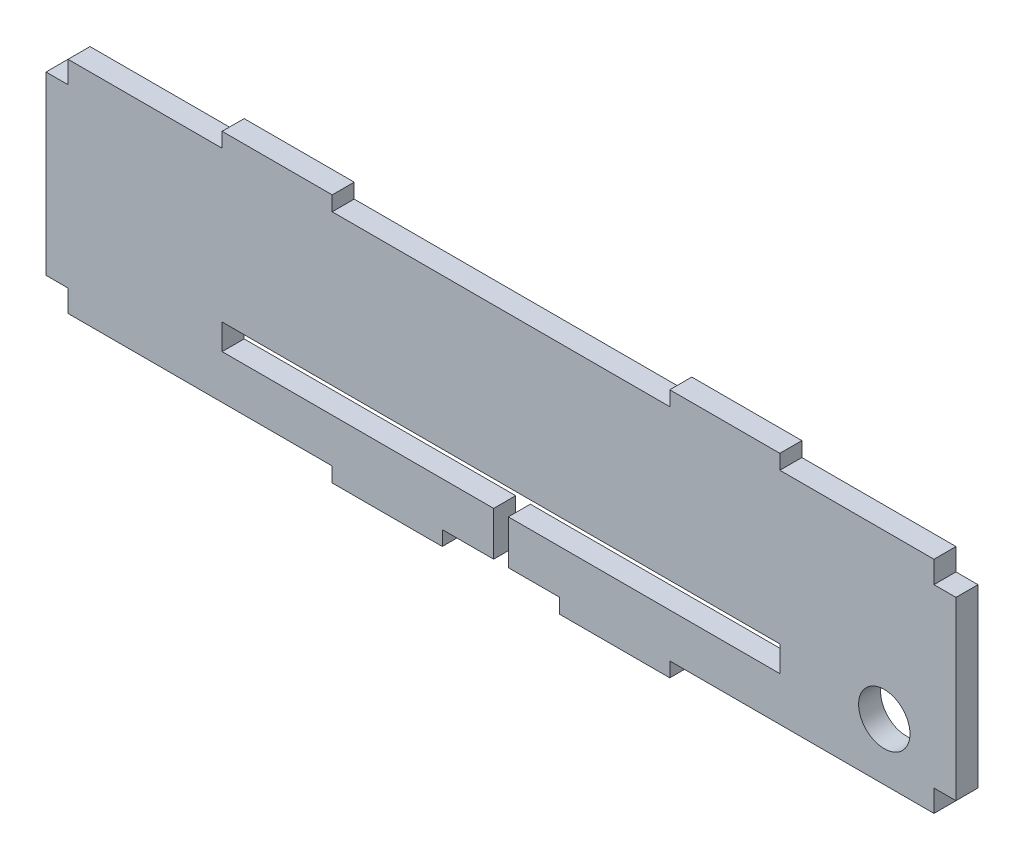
ISO-10303-21;
HEADER;
FILE_DESCRIPTION(('STEP AP214'),'2;1');
FILE_NAME('part.step','',(''),(''),'','','');
FILE_SCHEMA(('AUTOMOTIVE_DESIGN { 1 0 10303 214 1 1 1 1 }'));
ENDSEC;
DATA;
#1=APPLICATION_CONTEXT('core data for automotive mechanical design processes');
#2=APPLICATION_PROTOCOL_DEFINITION('international standard','automotive_design',2000,#1);
#3=PRODUCT_CONTEXT('',#1,'mechanical');
#4=PRODUCT('Part','Part','',(#3));
#5=PRODUCT_RELATED_PRODUCT_CATEGORY('part','',(#4));
#6=PRODUCT_DEFINITION_FORMATION('','',#4);
#7=PRODUCT_DEFINITION_CONTEXT('part definition',#1,'design');
#8=PRODUCT_DEFINITION('design','',#6,#7);
#9=PRODUCT_DEFINITION_SHAPE('','',#8);
#10=(LENGTH_UNIT() NAMED_UNIT(*) SI_UNIT(.MILLI.,.METRE.));
#11=(NAMED_UNIT(*) PLANE_ANGLE_UNIT() SI_UNIT($,.RADIAN.));
#12=(NAMED_UNIT(*) SI_UNIT($,.STERADIAN.) SOLID_ANGLE_UNIT());
#13=UNCERTAINTY_MEASURE_WITH_UNIT(LENGTH_MEASURE(1.E-05),#10,'distance_accuracy_value','');
#14=(GEOMETRIC_REPRESENTATION_CONTEXT(3) GLOBAL_UNCERTAINTY_ASSIGNED_CONTEXT((#13)) GLOBAL_UNIT_ASSIGNED_CONTEXT((#10,
#11,#12)) REPRESENTATION_CONTEXT('',''));
#15=CARTESIAN_POINT('',(0.,0.,0.));
#16=DIRECTION('',(0.,0.,1.));
#17=DIRECTION('',(1.,0.,0.));
#18=AXIS2_PLACEMENT_3D('',#15,#16,#17);
#19=CARTESIAN_POINT('',(0.,30.,3.));
#20=DIRECTION('',(0.,1.,0.));
#21=DIRECTION('',(0.,0.,1.));
#22=AXIS2_PLACEMENT_3D('',#19,#20,#21);
#23=PLANE('',#22);
#24=DIRECTION('',(1.,0.,0.));
#25=VECTOR('',#24,1.);
#26=CARTESIAN_POINT('',(0.,30.,0.));
#27=LINE('',#26,#25);
#28=CARTESIAN_POINT('',(6.00000000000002,30.,0.));
#29=VERTEX_POINT('',#28);
#30=CARTESIAN_POINT('',(27.,30.,0.));
#31=VERTEX_POINT('',#30);
#32=EDGE_CURVE('E388',#29,#31,#27,.T.);
#33=ORIENTED_EDGE('',*,*,#32,.F.);
#34=DIRECTION('',(0.,0.,-1.));
#35=VECTOR('',#34,1.);
#36=CARTESIAN_POINT('',(6.00000000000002,30.,3.));
#37=LINE('',#36,#35);
#38=CARTESIAN_POINT('',(6.00000000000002,30.,3.));
#39=VERTEX_POINT('',#38);
#40=EDGE_CURVE('E11',#39,#29,#37,.T.);
#41=ORIENTED_EDGE('',*,*,#40,.F.);
#42=DIRECTION('',(1.,0.,0.));
#43=VECTOR('',#42,1.);
#44=CARTESIAN_POINT('',(0.,30.,3.));
#45=LINE('',#44,#43);
#46=CARTESIAN_POINT('',(27.,30.,3.));
#47=VERTEX_POINT('',#46);
#48=EDGE_CURVE('E1069',#39,#47,#45,.T.);
#49=ORIENTED_EDGE('',*,*,#48,.T.);
#50=DIRECTION('',(0.,0.,-1.));
#51=VECTOR('',#50,1.);
#52=CARTESIAN_POINT('',(27.,30.,3.));
#53=LINE('',#52,#51);
#54=EDGE_CURVE('E53',#47,#31,#53,.T.);
#55=ORIENTED_EDGE('',*,*,#54,.T.);
#56=EDGE_LOOP('',(#33,#41,#49,#55));
#57=FACE_BOUND('',#56,.T.);
#58=ADVANCED_FACE('F36',(#57),#23,.T.);
#59=CARTESIAN_POINT('',(6.00000000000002,0.,3.));
#60=DIRECTION('',(1.,0.,0.));
#61=DIRECTION('',(0.,0.,-1.));
#62=AXIS2_PLACEMENT_3D('',#59,#60,#61);
#63=PLANE('',#62);
#64=DIRECTION('',(0.,-1.,0.));
#65=VECTOR('',#64,1.);
#66=CARTESIAN_POINT('',(6.00000000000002,0.,0.));
#67=LINE('',#66,#65);
#68=CARTESIAN_POINT('',(6.00000000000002,27.,0.));
#69=VERTEX_POINT('',#68);
#70=EDGE_CURVE('E385',#29,#69,#67,.T.);
#71=ORIENTED_EDGE('',*,*,#70,.T.);
#72=DIRECTION('',(0.,0.,-1.));
#73=VECTOR('',#72,1.);
#74=CARTESIAN_POINT('',(6.00000000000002,27.,3.));
#75=LINE('',#74,#73);
#76=CARTESIAN_POINT('',(6.00000000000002,27.,3.));
#77=VERTEX_POINT('',#76);
#78=EDGE_CURVE('E45',#77,#69,#75,.T.);
#79=ORIENTED_EDGE('',*,*,#78,.F.);
#80=DIRECTION('',(0.,-1.,0.));
#81=VECTOR('',#80,1.);
#82=CARTESIAN_POINT('',(6.00000000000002,0.,3.));
#83=LINE('',#82,#81);
#84=EDGE_CURVE('E1067',#39,#77,#83,.T.);
#85=ORIENTED_EDGE('',*,*,#84,.F.);
#86=ORIENTED_EDGE('',*,*,#40,.T.);
#87=EDGE_LOOP('',(#71,#79,#85,#86));
#88=FACE_BOUND('',#87,.T.);
#89=ADVANCED_FACE('F386',(#88),#63,.F.);
#90=CARTESIAN_POINT('',(0.,27.,3.));
#91=DIRECTION('',(0.,1.,0.));
#92=DIRECTION('',(0.,0.,1.));
#93=AXIS2_PLACEMENT_3D('',#90,#91,#92);
#94=PLANE('',#93);
#95=DIRECTION('',(1.,0.,0.));
#96=VECTOR('',#95,1.);
#97=CARTESIAN_POINT('',(0.,27.,0.));
#98=LINE('',#97,#96);
#99=CARTESIAN_POINT('',(3.00000000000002,27.,0.));
#100=VERTEX_POINT('',#99);
#101=EDGE_CURVE('E379',#100,#69,#98,.T.);
#102=ORIENTED_EDGE('',*,*,#101,.F.);
#103=DIRECTION('',(0.,0.,-1.));
#104=VECTOR('',#103,1.);
#105=CARTESIAN_POINT('',(3.00000000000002,27.,3.));
#106=LINE('',#105,#104);
#107=CARTESIAN_POINT('',(3.00000000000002,27.,3.));
#108=VERTEX_POINT('',#107);
#109=EDGE_CURVE('E371',#108,#100,#106,.T.);
#110=ORIENTED_EDGE('',*,*,#109,.F.);
#111=DIRECTION('',(1.,0.,0.));
#112=VECTOR('',#111,1.);
#113=CARTESIAN_POINT('',(0.,27.,3.));
#114=LINE('',#113,#112);
#115=EDGE_CURVE('E382',#108,#77,#114,.T.);
#116=ORIENTED_EDGE('',*,*,#115,.T.);
#117=ORIENTED_EDGE('',*,*,#78,.T.);
#118=EDGE_LOOP('',(#102,#110,#116,#117));
#119=FACE_BOUND('',#118,.T.);
#120=ADVANCED_FACE('F377',(#119),#94,.T.);
#121=CARTESIAN_POINT('',(3.00000000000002,0.,3.));
#122=DIRECTION('',(-1.,0.,0.));
#123=DIRECTION('',(0.,0.,1.));
#124=AXIS2_PLACEMENT_3D('',#121,#122,#123);
#125=PLANE('',#124);
#126=DIRECTION('',(0.,1.,0.));
#127=VECTOR('',#126,1.);
#128=CARTESIAN_POINT('',(3.00000000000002,0.,0.));
#129=LINE('',#128,#127);
#130=CARTESIAN_POINT('',(3.00000000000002,3.,0.));
#131=VERTEX_POINT('',#130);
#132=EDGE_CURVE('E393',#131,#100,#129,.T.);
#133=ORIENTED_EDGE('',*,*,#132,.F.);
#134=DIRECTION('',(0.,0.,-1.));
#135=VECTOR('',#134,1.);
#136=CARTESIAN_POINT('',(3.00000000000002,3.,3.));
#137=LINE('',#136,#135);
#138=CARTESIAN_POINT('',(3.00000000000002,3.,3.));
#139=VERTEX_POINT('',#138);
#140=EDGE_CURVE('E369',#139,#131,#137,.T.);
#141=ORIENTED_EDGE('',*,*,#140,.F.);
#142=DIRECTION('',(0.,1.,0.));
#143=VECTOR('',#142,1.);
#144=CARTESIAN_POINT('',(3.00000000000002,0.,3.));
#145=LINE('',#144,#143);
#146=EDGE_CURVE('E1063',#139,#108,#145,.T.);
#147=ORIENTED_EDGE('',*,*,#146,.T.);
#148=ORIENTED_EDGE('',*,*,#109,.T.);
#149=EDGE_LOOP('',(#133,#141,#147,#148));
#150=FACE_BOUND('',#149,.T.);
#151=ADVANCED_FACE('F513',(#150),#125,.T.);
#152=CARTESIAN_POINT('',(0.,3.,3.));
#153=DIRECTION('',(0.,1.,0.));
#154=DIRECTION('',(0.,0.,1.));
#155=AXIS2_PLACEMENT_3D('',#152,#153,#154);
#156=PLANE('',#155);
#157=DIRECTION('',(1.,0.,0.));
#158=VECTOR('',#157,1.);
#159=CARTESIAN_POINT('',(0.,3.,0.));
#160=LINE('',#159,#158);
#161=CARTESIAN_POINT('',(6.00000000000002,3.,0.));
#162=VERTEX_POINT('',#161);
#163=EDGE_CURVE('E395',#131,#162,#160,.T.);
#164=ORIENTED_EDGE('',*,*,#163,.T.);
#165=DIRECTION('',(0.,0.,-1.));
#166=VECTOR('',#165,1.);
#167=CARTESIAN_POINT('',(6.00000000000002,3.,3.));
#168=LINE('',#167,#166);
#169=CARTESIAN_POINT('',(6.00000000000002,3.,3.));
#170=VERTEX_POINT('',#169);
#171=EDGE_CURVE('E367',#170,#162,#168,.T.);
#172=ORIENTED_EDGE('',*,*,#171,.F.);
#173=DIRECTION('',(1.,0.,0.));
#174=VECTOR('',#173,1.);
#175=CARTESIAN_POINT('',(0.,3.,3.));
#176=LINE('',#175,#174);
#177=EDGE_CURVE('E1061',#139,#170,#176,.T.);
#178=ORIENTED_EDGE('',*,*,#177,.F.);
#179=ORIENTED_EDGE('',*,*,#140,.T.);
#180=EDGE_LOOP('',(#164,#172,#178,#179));
#181=FACE_BOUND('',#180,.T.);
#182=ADVANCED_FACE('F516',(#181),#156,.F.);
#183=CARTESIAN_POINT('',(6.00000000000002,0.,3.));
#184=DIRECTION('',(-1.,0.,0.));
#185=DIRECTION('',(0.,0.,1.));
#186=AXIS2_PLACEMENT_3D('',#183,#184,#185);
#187=PLANE('',#186);
#188=DIRECTION('',(0.,1.,0.));
#189=VECTOR('',#188,1.);
#190=CARTESIAN_POINT('',(6.00000000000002,0.,0.));
#191=LINE('',#190,#189);
#192=CARTESIAN_POINT('',(6.00000000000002,0.,0.));
#193=VERTEX_POINT('',#192);
#194=EDGE_CURVE('E401',#193,#162,#191,.T.);
#195=ORIENTED_EDGE('',*,*,#194,.F.);
#196=DIRECTION('',(0.,0.,-1.));
#197=VECTOR('',#196,1.);
#198=CARTESIAN_POINT('',(6.00000000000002,0.,3.));
#199=LINE('',#198,#197);
#200=CARTESIAN_POINT('',(6.00000000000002,0.,3.));
#201=VERTEX_POINT('',#200);
#202=EDGE_CURVE('E365',#201,#193,#199,.T.);
#203=ORIENTED_EDGE('',*,*,#202,.F.);
#204=DIRECTION('',(0.,1.,0.));
#205=VECTOR('',#204,1.);
#206=CARTESIAN_POINT('',(6.00000000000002,0.,3.));
#207=LINE('',#206,#205);
#208=EDGE_CURVE('E1058',#201,#170,#207,.T.);
#209=ORIENTED_EDGE('',*,*,#208,.T.);
#210=ORIENTED_EDGE('',*,*,#171,.T.);
#211=EDGE_LOOP('',(#195,#203,#209,#210));
#212=FACE_BOUND('',#211,.T.);
#213=ADVANCED_FACE('F520',(#212),#187,.T.);
#214=CARTESIAN_POINT('',(0.,0.,3.));
#215=DIRECTION('',(0.,1.,0.));
#216=DIRECTION('',(0.,0.,1.));
#217=AXIS2_PLACEMENT_3D('',#214,#215,#216);
#218=PLANE('',#217);
#219=DIRECTION('',(1.,0.,0.));
#220=VECTOR('',#219,1.);
#221=CARTESIAN_POINT('',(0.,0.,0.));
#222=LINE('',#221,#220);
#223=CARTESIAN_POINT('',(42.,0.,0.));
#224=VERTEX_POINT('',#223);
#225=EDGE_CURVE('E404',#193,#224,#222,.T.);
#226=ORIENTED_EDGE('',*,*,#225,.T.);
#227=DIRECTION('',(0.,0.,-1.));
#228=VECTOR('',#227,1.);
#229=CARTESIAN_POINT('',(42.,0.,3.));
#230=LINE('',#229,#228);
#231=CARTESIAN_POINT('',(42.,0.,3.));
#232=VERTEX_POINT('',#231);
#233=EDGE_CURVE('E362',#232,#224,#230,.T.);
#234=ORIENTED_EDGE('',*,*,#233,.F.);
#235=DIRECTION('',(1.,0.,0.));
#236=VECTOR('',#235,1.);
#237=CARTESIAN_POINT('',(0.,0.,3.));
#238=LINE('',#237,#236);
#239=EDGE_CURVE('E1055',#201,#232,#238,.T.);
#240=ORIENTED_EDGE('',*,*,#239,.F.);
#241=ORIENTED_EDGE('',*,*,#202,.T.);
#242=EDGE_LOOP('',(#226,#234,#240,#241));
#243=FACE_BOUND('',#242,.T.);
#244=ADVANCED_FACE('F524',(#243),#218,.F.);
#245=CARTESIAN_POINT('',(42.,2.91433543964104E-13,3.));
#246=DIRECTION('',(1.,0.,0.));
#247=DIRECTION('',(0.,1.,0.));
#248=AXIS2_PLACEMENT_3D('',#245,#246,#247);
#249=PLANE('',#248);
#250=DIRECTION('',(0.,-1.,0.));
#251=VECTOR('',#250,1.);
#252=CARTESIAN_POINT('',(42.,2.91433543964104E-13,0.));
#253=LINE('',#252,#251);
#254=CARTESIAN_POINT('',(42.,-2.,0.));
#255=VERTEX_POINT('',#254);
#256=EDGE_CURVE('E407',#224,#255,#253,.T.);
#257=ORIENTED_EDGE('',*,*,#256,.T.);
#258=DIRECTION('',(0.,0.,-1.));
#259=VECTOR('',#258,1.);
#260=CARTESIAN_POINT('',(42.,-2.,3.));
#261=LINE('',#260,#259);
#262=CARTESIAN_POINT('',(42.,-2.,3.));
#263=VERTEX_POINT('',#262);
#264=EDGE_CURVE('E359',#263,#255,#261,.T.);
#265=ORIENTED_EDGE('',*,*,#264,.F.);
#266=DIRECTION('',(0.,-1.,0.));
#267=VECTOR('',#266,1.);
#268=CARTESIAN_POINT('',(42.,2.91433543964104E-13,3.));
#269=LINE('',#268,#267);
#270=EDGE_CURVE('E1052',#232,#263,#269,.T.);
#271=ORIENTED_EDGE('',*,*,#270,.F.);
#272=ORIENTED_EDGE('',*,*,#233,.T.);
#273=EDGE_LOOP('',(#257,#265,#271,#272));
#274=FACE_BOUND('',#273,.T.);
#275=ADVANCED_FACE('F528',(#274),#249,.F.);
#276=CARTESIAN_POINT('',(0.,-2.,3.));
#277=DIRECTION('',(0.,1.,0.));
#278=DIRECTION('',(-1.,0.,0.));
#279=AXIS2_PLACEMENT_3D('',#276,#277,#278);
#280=PLANE('',#279);
#281=DIRECTION('',(1.,0.,0.));
#282=VECTOR('',#281,1.);
#283=CARTESIAN_POINT('',(0.,-2.,0.));
#284=LINE('',#283,#282);
#285=CARTESIAN_POINT('',(57.,-2.,0.));
#286=VERTEX_POINT('',#285);
#287=EDGE_CURVE('E410',#255,#286,#284,.T.);
#288=ORIENTED_EDGE('',*,*,#287,.T.);
#289=DIRECTION('',(0.,0.,-1.));
#290=VECTOR('',#289,1.);
#291=CARTESIAN_POINT('',(57.,-2.,3.));
#292=LINE('',#291,#290);
#293=CARTESIAN_POINT('',(57.,-2.,3.));
#294=VERTEX_POINT('',#293);
#295=EDGE_CURVE('E356',#294,#286,#292,.T.);
#296=ORIENTED_EDGE('',*,*,#295,.F.);
#297=DIRECTION('',(1.,0.,0.));
#298=VECTOR('',#297,1.);
#299=CARTESIAN_POINT('',(0.,-2.,3.));
#300=LINE('',#299,#298);
#301=EDGE_CURVE('E960',#263,#294,#300,.T.);
#302=ORIENTED_EDGE('',*,*,#301,.F.);
#303=ORIENTED_EDGE('',*,*,#264,.T.);
#304=EDGE_LOOP('',(#288,#296,#302,#303));
#305=FACE_BOUND('',#304,.T.);
#306=ADVANCED_FACE('F532',(#305),#280,.F.);
#307=CARTESIAN_POINT('',(57.,0.,3.));
#308=DIRECTION('',(-1.,0.,0.));
#309=DIRECTION('',(0.,0.,1.));
#310=AXIS2_PLACEMENT_3D('',#307,#308,#309);
#311=PLANE('',#310);
#312=DIRECTION('',(0.,1.,0.));
#313=VECTOR('',#312,1.);
#314=CARTESIAN_POINT('',(57.,0.,0.));
#315=LINE('',#314,#313);
#316=CARTESIAN_POINT('',(57.,0.,0.));
#317=VERTEX_POINT('',#316);
#318=EDGE_CURVE('E413',#286,#317,#315,.T.);
#319=ORIENTED_EDGE('',*,*,#318,.T.);
#320=DIRECTION('',(0.,0.,-1.));
#321=VECTOR('',#320,1.);
#322=CARTESIAN_POINT('',(57.,0.,3.));
#323=LINE('',#322,#321);
#324=CARTESIAN_POINT('',(57.,0.,3.));
#325=VERTEX_POINT('',#324);
#326=EDGE_CURVE('E353',#325,#317,#323,.T.);
#327=ORIENTED_EDGE('',*,*,#326,.F.);
#328=DIRECTION('',(0.,1.,0.));
#329=VECTOR('',#328,1.);
#330=CARTESIAN_POINT('',(57.,0.,3.));
#331=LINE('',#330,#329);
#332=EDGE_CURVE('E957',#294,#325,#331,.T.);
#333=ORIENTED_EDGE('',*,*,#332,.F.);
#334=ORIENTED_EDGE('',*,*,#295,.T.);
#335=EDGE_LOOP('',(#319,#327,#333,#334));
#336=FACE_BOUND('',#335,.T.);
#337=ADVANCED_FACE('F536',(#336),#311,.F.);
#338=CARTESIAN_POINT('',(0.,0.,3.));
#339=DIRECTION('',(0.,1.,0.));
#340=DIRECTION('',(-1.,0.,0.));
#341=AXIS2_PLACEMENT_3D('',#338,#339,#340);
#342=PLANE('',#341);
#343=DIRECTION('',(1.,0.,0.));
#344=VECTOR('',#343,1.);
#345=CARTESIAN_POINT('',(0.,0.,0.));
#346=LINE('',#345,#344);
#347=CARTESIAN_POINT('',(64.,0.,0.));
#348=VERTEX_POINT('',#347);
#349=EDGE_CURVE('E416',#317,#348,#346,.T.);
#350=ORIENTED_EDGE('',*,*,#349,.T.);
#351=DIRECTION('',(0.,0.,-1.));
#352=VECTOR('',#351,1.);
#353=CARTESIAN_POINT('',(64.,0.,3.));
#354=LINE('',#353,#352);
#355=CARTESIAN_POINT('',(64.,0.,3.));
#356=VERTEX_POINT('',#355);
#357=EDGE_CURVE('E350',#356,#348,#354,.T.);
#358=ORIENTED_EDGE('',*,*,#357,.F.);
#359=DIRECTION('',(1.,0.,0.));
#360=VECTOR('',#359,1.);
#361=CARTESIAN_POINT('',(0.,0.,3.));
#362=LINE('',#361,#360);
#363=EDGE_CURVE('E953',#325,#356,#362,.T.);
#364=ORIENTED_EDGE('',*,*,#363,.F.);
#365=ORIENTED_EDGE('',*,*,#326,.T.);
#366=EDGE_LOOP('',(#350,#358,#364,#365));
#367=FACE_BOUND('',#366,.T.);
#368=ADVANCED_FACE('F540',(#367),#342,.F.);
#369=CARTESIAN_POINT('',(64.,0.,3.));
#370=DIRECTION('',(-1.,0.,0.));
#371=DIRECTION('',(0.,0.,1.));
#372=AXIS2_PLACEMENT_3D('',#369,#370,#371);
#373=PLANE('',#372);
#374=DIRECTION('',(0.,1.,0.));
#375=VECTOR('',#374,1.);
#376=CARTESIAN_POINT('',(64.,0.,0.));
#377=LINE('',#376,#375);
#378=CARTESIAN_POINT('',(64.,6.,0.));
#379=VERTEX_POINT('',#378);
#380=EDGE_CURVE('E419',#348,#379,#377,.T.);
#381=ORIENTED_EDGE('',*,*,#380,.T.);
#382=DIRECTION('',(0.,0.,-1.));
#383=VECTOR('',#382,1.);
#384=CARTESIAN_POINT('',(64.,6.,3.));
#385=LINE('',#384,#383);
#386=CARTESIAN_POINT('',(64.,6.,3.));
#387=VERTEX_POINT('',#386);
#388=EDGE_CURVE('E348',#387,#379,#385,.T.);
#389=ORIENTED_EDGE('',*,*,#388,.F.);
#390=DIRECTION('',(0.,1.,0.));
#391=VECTOR('',#390,1.);
#392=CARTESIAN_POINT('',(64.,0.,3.));
#393=LINE('',#392,#391);
#394=EDGE_CURVE('E948',#356,#387,#393,.T.);
#395=ORIENTED_EDGE('',*,*,#394,.F.);
#396=ORIENTED_EDGE('',*,*,#357,.T.);
#397=EDGE_LOOP('',(#381,#389,#395,#396));
#398=FACE_BOUND('',#397,.T.);
#399=ADVANCED_FACE('F542',(#398),#373,.F.);
#400=CARTESIAN_POINT('',(0.,6.,3.));
#401=DIRECTION('',(0.,1.,0.));
#402=DIRECTION('',(0.,0.,1.));
#403=AXIS2_PLACEMENT_3D('',#400,#401,#402);
#404=PLANE('',#403);
#405=DIRECTION('',(1.,0.,0.));
#406=VECTOR('',#405,1.);
#407=CARTESIAN_POINT('',(0.,6.,0.));
#408=LINE('',#407,#406);
#409=CARTESIAN_POINT('',(27.,6.,0.));
#410=VERTEX_POINT('',#409);
#411=EDGE_CURVE('E423',#410,#379,#408,.T.);
#412=ORIENTED_EDGE('',*,*,#411,.F.);
#413=DIRECTION('',(0.,0.,-1.));
#414=VECTOR('',#413,1.);
#415=CARTESIAN_POINT('',(27.,6.,3.));
#416=LINE('',#415,#414);
#417=CARTESIAN_POINT('',(27.,6.,3.));
#418=VERTEX_POINT('',#417);
#419=EDGE_CURVE('E346',#418,#410,#416,.T.);
#420=ORIENTED_EDGE('',*,*,#419,.F.);
#421=DIRECTION('',(1.,0.,0.));
#422=VECTOR('',#421,1.);
#423=CARTESIAN_POINT('',(0.,6.,3.));
#424=LINE('',#423,#422);
#425=EDGE_CURVE('E952',#418,#387,#424,.T.);
#426=ORIENTED_EDGE('',*,*,#425,.T.);
#427=ORIENTED_EDGE('',*,*,#388,.T.);
#428=EDGE_LOOP('',(#412,#420,#426,#427));
#429=FACE_BOUND('',#428,.T.);
#430=ADVANCED_FACE('F545',(#429),#404,.T.);
#431=CARTESIAN_POINT('',(27.,0.,3.));
#432=DIRECTION('',(1.,0.,0.));
#433=DIRECTION('',(0.,0.,-1.));
#434=AXIS2_PLACEMENT_3D('',#431,#432,#433);
#435=PLANE('',#434);
#436=DIRECTION('',(0.,-1.,0.));
#437=VECTOR('',#436,1.);
#438=CARTESIAN_POINT('',(27.,0.,0.));
#439=LINE('',#438,#437);
#440=CARTESIAN_POINT('',(27.,9.5,0.));
#441=VERTEX_POINT('',#440);
#442=EDGE_CURVE('E426',#441,#410,#439,.T.);
#443=ORIENTED_EDGE('',*,*,#442,.F.);
#444=DIRECTION('',(0.,0.,-1.));
#445=VECTOR('',#444,1.);
#446=CARTESIAN_POINT('',(27.,9.5,3.));
#447=LINE('',#446,#445);
#448=CARTESIAN_POINT('',(27.,9.5,3.));
#449=VERTEX_POINT('',#448);
#450=EDGE_CURVE('E344',#449,#441,#447,.T.);
#451=ORIENTED_EDGE('',*,*,#450,.F.);
#452=DIRECTION('',(0.,-1.,0.));
#453=VECTOR('',#452,1.);
#454=CARTESIAN_POINT('',(27.,0.,3.));
#455=LINE('',#454,#453);
#456=EDGE_CURVE('E1045',#449,#418,#455,.T.);
#457=ORIENTED_EDGE('',*,*,#456,.T.);
#458=ORIENTED_EDGE('',*,*,#419,.T.);
#459=EDGE_LOOP('',(#443,#451,#457,#458));
#460=FACE_BOUND('',#459,.T.);
#461=ADVANCED_FACE('F549',(#460),#435,.T.);
#462=CARTESIAN_POINT('',(0.,9.5,3.));
#463=DIRECTION('',(0.,1.,0.));
#464=DIRECTION('',(0.,0.,1.));
#465=AXIS2_PLACEMENT_3D('',#462,#463,#464);
#466=PLANE('',#465);
#467=DIRECTION('',(1.,0.,0.));
#468=VECTOR('',#467,1.);
#469=CARTESIAN_POINT('',(0.,9.5,0.));
#470=LINE('',#469,#468);
#471=CARTESIAN_POINT('',(103.,9.5,0.));
#472=VERTEX_POINT('',#471);
#473=EDGE_CURVE('E429',#441,#472,#470,.T.);
#474=ORIENTED_EDGE('',*,*,#473,.T.);
#475=DIRECTION('',(0.,0.,-1.));
#476=VECTOR('',#475,1.);
#477=CARTESIAN_POINT('',(103.,9.5,3.));
#478=LINE('',#477,#476);
#479=CARTESIAN_POINT('',(103.,9.5,3.));
#480=VERTEX_POINT('',#479);
#481=EDGE_CURVE('E341',#480,#472,#478,.T.);
#482=ORIENTED_EDGE('',*,*,#481,.F.);
#483=DIRECTION('',(1.,0.,0.));
#484=VECTOR('',#483,1.);
#485=CARTESIAN_POINT('',(0.,9.5,3.));
#486=LINE('',#485,#484);
#487=EDGE_CURVE('E1047',#449,#480,#486,.T.);
#488=ORIENTED_EDGE('',*,*,#487,.F.);
#489=ORIENTED_EDGE('',*,*,#450,.T.);
#490=EDGE_LOOP('',(#474,#482,#488,#489));
#491=FACE_BOUND('',#490,.T.);
#492=ADVANCED_FACE('F553',(#491),#466,.F.);
#493=CARTESIAN_POINT('',(103.,0.,3.));
#494=DIRECTION('',(1.,0.,0.));
#495=DIRECTION('',(0.,0.,-1.));
#496=AXIS2_PLACEMENT_3D('',#493,#494,#495);
#497=PLANE('',#496);
#498=DIRECTION('',(0.,-1.,0.));
#499=VECTOR('',#498,1.);
#500=CARTESIAN_POINT('',(103.,0.,0.));
#501=LINE('',#500,#499);
#502=CARTESIAN_POINT('',(103.,6.,0.));
#503=VERTEX_POINT('',#502);
#504=EDGE_CURVE('E432',#472,#503,#501,.T.);
#505=ORIENTED_EDGE('',*,*,#504,.T.);
#506=DIRECTION('',(0.,0.,-1.));
#507=VECTOR('',#506,1.);
#508=CARTESIAN_POINT('',(103.,6.,3.));
#509=LINE('',#508,#507);
#510=CARTESIAN_POINT('',(103.,6.,3.));
#511=VERTEX_POINT('',#510);
#512=EDGE_CURVE('E339',#511,#503,#509,.T.);
#513=ORIENTED_EDGE('',*,*,#512,.F.);
#514=DIRECTION('',(0.,-1.,0.));
#515=VECTOR('',#514,1.);
#516=CARTESIAN_POINT('',(103.,0.,3.));
#517=LINE('',#516,#515);
#518=EDGE_CURVE('E975',#480,#511,#517,.T.);
#519=ORIENTED_EDGE('',*,*,#518,.F.);
#520=ORIENTED_EDGE('',*,*,#481,.T.);
#521=EDGE_LOOP('',(#505,#513,#519,#520));
#522=FACE_BOUND('',#521,.T.);
#523=ADVANCED_FACE('F557',(#522),#497,.F.);
#524=CARTESIAN_POINT('',(0.,6.,3.));
#525=DIRECTION('',(0.,1.,0.));
#526=DIRECTION('',(0.,0.,1.));
#527=AXIS2_PLACEMENT_3D('',#524,#525,#526);
#528=PLANE('',#527);
#529=DIRECTION('',(1.,0.,0.));
#530=VECTOR('',#529,1.);
#531=CARTESIAN_POINT('',(0.,6.,0.));
#532=LINE('',#531,#530);
#533=CARTESIAN_POINT('',(66.,6.,0.));
#534=VERTEX_POINT('',#533);
#535=EDGE_CURVE('E435',#534,#503,#532,.T.);
#536=ORIENTED_EDGE('',*,*,#535,.F.);
#537=DIRECTION('',(0.,0.,-1.));
#538=VECTOR('',#537,1.);
#539=CARTESIAN_POINT('',(66.,6.,3.));
#540=LINE('',#539,#538);
#541=CARTESIAN_POINT('',(66.,6.,3.));
#542=VERTEX_POINT('',#541);
#543=EDGE_CURVE('E337',#542,#534,#540,.T.);
#544=ORIENTED_EDGE('',*,*,#543,.F.);
#545=DIRECTION('',(1.,0.,0.));
#546=VECTOR('',#545,1.);
#547=CARTESIAN_POINT('',(0.,6.,3.));
#548=LINE('',#547,#546);
#549=EDGE_CURVE('E972',#542,#511,#548,.T.);
#550=ORIENTED_EDGE('',*,*,#549,.T.);
#551=ORIENTED_EDGE('',*,*,#512,.T.);
#552=EDGE_LOOP('',(#536,#544,#550,#551));
#553=FACE_BOUND('',#552,.T.);
#554=ADVANCED_FACE('F561',(#553),#528,.T.);
#555=CARTESIAN_POINT('',(66.,0.,3.));
#556=DIRECTION('',(-1.,0.,0.));
#557=DIRECTION('',(0.,0.,1.));
#558=AXIS2_PLACEMENT_3D('',#555,#556,#557);
#559=PLANE('',#558);
#560=DIRECTION('',(0.,1.,0.));
#561=VECTOR('',#560,1.);
#562=CARTESIAN_POINT('',(66.,0.,0.));
#563=LINE('',#562,#561);
#564=CARTESIAN_POINT('',(66.,0.,0.));
#565=VERTEX_POINT('',#564);
#566=EDGE_CURVE('E438',#565,#534,#563,.T.);
#567=ORIENTED_EDGE('',*,*,#566,.F.);
#568=DIRECTION('',(0.,0.,-1.));
#569=VECTOR('',#568,1.);
#570=CARTESIAN_POINT('',(66.,0.,3.));
#571=LINE('',#570,#569);
#572=CARTESIAN_POINT('',(66.,0.,3.));
#573=VERTEX_POINT('',#572);
#574=EDGE_CURVE('E335',#573,#565,#571,.T.);
#575=ORIENTED_EDGE('',*,*,#574,.F.);
#576=DIRECTION('',(0.,1.,0.));
#577=VECTOR('',#576,1.);
#578=CARTESIAN_POINT('',(66.,0.,3.));
#579=LINE('',#578,#577);
#580=EDGE_CURVE('E964',#573,#542,#579,.T.);
#581=ORIENTED_EDGE('',*,*,#580,.T.);
#582=ORIENTED_EDGE('',*,*,#543,.T.);
#583=EDGE_LOOP('',(#567,#575,#581,#582));
#584=FACE_BOUND('',#583,.T.);
#585=ADVANCED_FACE('F565',(#584),#559,.T.);
#586=CARTESIAN_POINT('',(73.,0.,0.));
#587=VERTEX_POINT('',#586);
#588=EDGE_CURVE('E420',#565,#587,#346,.T.);
#589=ORIENTED_EDGE('',*,*,#588,.T.);
#590=DIRECTION('',(0.,0.,-1.));
#591=VECTOR('',#590,1.);
#592=CARTESIAN_POINT('',(73.,0.,3.));
#593=LINE('',#592,#591);
#594=CARTESIAN_POINT('',(73.,0.,3.));
#595=VERTEX_POINT('',#594);
#596=EDGE_CURVE('E332',#595,#587,#593,.T.);
#597=ORIENTED_EDGE('',*,*,#596,.F.);
#598=EDGE_CURVE('E959',#573,#595,#362,.T.);
#599=ORIENTED_EDGE('',*,*,#598,.F.);
#600=ORIENTED_EDGE('',*,*,#574,.T.);
#601=EDGE_LOOP('',(#589,#597,#599,#600));
#602=FACE_BOUND('',#601,.T.);
#603=ADVANCED_FACE('F569',(#602),#342,.F.);
#604=CARTESIAN_POINT('',(73.,0.,3.));
#605=DIRECTION('',(1.,0.,0.));
#606=DIRECTION('',(0.,0.,-1.));
#607=AXIS2_PLACEMENT_3D('',#604,#605,#606);
#608=PLANE('',#607);
#609=DIRECTION('',(0.,-1.,0.));
#610=VECTOR('',#609,1.);
#611=CARTESIAN_POINT('',(73.,0.,0.));
#612=LINE('',#611,#610);
#613=CARTESIAN_POINT('',(73.,-2.,0.));
#614=VERTEX_POINT('',#613);
#615=EDGE_CURVE('E441',#587,#614,#612,.T.);
#616=ORIENTED_EDGE('',*,*,#615,.T.);
#617=DIRECTION('',(0.,0.,-1.));
#618=VECTOR('',#617,1.);
#619=CARTESIAN_POINT('',(73.,-2.,3.));
#620=LINE('',#619,#618);
#621=CARTESIAN_POINT('',(73.,-2.,3.));
#622=VERTEX_POINT('',#621);
#623=EDGE_CURVE('E329',#622,#614,#620,.T.);
#624=ORIENTED_EDGE('',*,*,#623,.F.);
#625=DIRECTION('',(0.,-1.,0.));
#626=VECTOR('',#625,1.);
#627=CARTESIAN_POINT('',(73.,0.,3.));
#628=LINE('',#627,#626);
#629=EDGE_CURVE('E963',#595,#622,#628,.T.);
#630=ORIENTED_EDGE('',*,*,#629,.F.);
#631=ORIENTED_EDGE('',*,*,#596,.T.);
#632=EDGE_LOOP('',(#616,#624,#630,#631));
#633=FACE_BOUND('',#632,.T.);
#634=ADVANCED_FACE('F573',(#633),#608,.F.);
#635=CARTESIAN_POINT('',(0.,-2.,3.));
#636=DIRECTION('',(0.,1.,0.));
#637=DIRECTION('',(-1.,0.,0.));
#638=AXIS2_PLACEMENT_3D('',#635,#636,#637);
#639=PLANE('',#638);
#640=DIRECTION('',(1.,0.,0.));
#641=VECTOR('',#640,1.);
#642=CARTESIAN_POINT('',(0.,-2.,0.));
#643=LINE('',#642,#641);
#644=CARTESIAN_POINT('',(88.,-2.,0.));
#645=VERTEX_POINT('',#644);
#646=EDGE_CURVE('E444',#614,#645,#643,.T.);
#647=ORIENTED_EDGE('',*,*,#646,.T.);
#648=DIRECTION('',(0.,0.,-1.));
#649=VECTOR('',#648,1.);
#650=CARTESIAN_POINT('',(88.,-2.,3.));
#651=LINE('',#650,#649);
#652=CARTESIAN_POINT('',(88.,-2.,3.));
#653=VERTEX_POINT('',#652);
#654=EDGE_CURVE('E326',#653,#645,#651,.T.);
#655=ORIENTED_EDGE('',*,*,#654,.F.);
#656=DIRECTION('',(1.,0.,0.));
#657=VECTOR('',#656,1.);
#658=CARTESIAN_POINT('',(0.,-2.,3.));
#659=LINE('',#658,#657);
#660=EDGE_CURVE('E969',#622,#653,#659,.T.);
#661=ORIENTED_EDGE('',*,*,#660,.F.);
#662=ORIENTED_EDGE('',*,*,#623,.T.);
#663=EDGE_LOOP('',(#647,#655,#661,#662));
#664=FACE_BOUND('',#663,.T.);
#665=ADVANCED_FACE('F577',(#664),#639,.F.);
#666=CARTESIAN_POINT('',(88.,-6.10622663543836E-13,3.));
#667=DIRECTION('',(-1.,0.,0.));
#668=DIRECTION('',(0.,-1.,0.));
#669=AXIS2_PLACEMENT_3D('',#666,#667,#668);
#670=PLANE('',#669);
#671=DIRECTION('',(0.,1.,0.));
#672=VECTOR('',#671,1.);
#673=CARTESIAN_POINT('',(88.,-6.10622663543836E-13,0.));
#674=LINE('',#673,#672);
#675=CARTESIAN_POINT('',(88.,0.,0.));
#676=VERTEX_POINT('',#675);
#677=EDGE_CURVE('E447',#645,#676,#674,.T.);
#678=ORIENTED_EDGE('',*,*,#677,.T.);
#679=DIRECTION('',(0.,0.,-1.));
#680=VECTOR('',#679,1.);
#681=CARTESIAN_POINT('',(88.,0.,3.));
#682=LINE('',#681,#680);
#683=CARTESIAN_POINT('',(88.,0.,3.));
#684=VERTEX_POINT('',#683);
#685=EDGE_CURVE('E323',#684,#676,#682,.T.);
#686=ORIENTED_EDGE('',*,*,#685,.F.);
#687=DIRECTION('',(0.,1.,0.));
#688=VECTOR('',#687,1.);
#689=CARTESIAN_POINT('',(88.,-6.10622663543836E-13,3.));
#690=LINE('',#689,#688);
#691=EDGE_CURVE('E981',#653,#684,#690,.T.);
#692=ORIENTED_EDGE('',*,*,#691,.F.);
#693=ORIENTED_EDGE('',*,*,#654,.T.);
#694=EDGE_LOOP('',(#678,#686,#692,#693));
#695=FACE_BOUND('',#694,.T.);
#696=ADVANCED_FACE('F581',(#695),#670,.F.);
#697=CARTESIAN_POINT('',(0.,0.,3.));
#698=DIRECTION('',(0.,1.,0.));
#699=DIRECTION('',(-1.,0.,0.));
#700=AXIS2_PLACEMENT_3D('',#697,#698,#699);
#701=PLANE('',#700);
#702=DIRECTION('',(1.,0.,0.));
#703=VECTOR('',#702,1.);
#704=CARTESIAN_POINT('',(0.,0.,0.));
#705=LINE('',#704,#703);
#706=CARTESIAN_POINT('',(124.,0.,0.));
#707=VERTEX_POINT('',#706);
#708=EDGE_CURVE('E450',#676,#707,#705,.T.);
#709=ORIENTED_EDGE('',*,*,#708,.T.);
#710=DIRECTION('',(0.,0.,-1.));
#711=VECTOR('',#710,1.);
#712=CARTESIAN_POINT('',(124.,0.,3.));
#713=LINE('',#712,#711);
#714=CARTESIAN_POINT('',(124.,0.,3.));
#715=VERTEX_POINT('',#714);
#716=EDGE_CURVE('E320',#715,#707,#713,.T.);
#717=ORIENTED_EDGE('',*,*,#716,.F.);
#718=DIRECTION('',(1.,0.,0.));
#719=VECTOR('',#718,1.);
#720=CARTESIAN_POINT('',(0.,0.,3.));
#721=LINE('',#720,#719);
#722=EDGE_CURVE('E984',#684,#715,#721,.T.);
#723=ORIENTED_EDGE('',*,*,#722,.F.);
#724=ORIENTED_EDGE('',*,*,#685,.T.);
#725=EDGE_LOOP('',(#709,#717,#723,#724));
#726=FACE_BOUND('',#725,.T.);
#727=ADVANCED_FACE('F585',(#726),#701,.F.);
#728=CARTESIAN_POINT('',(124.,0.,3.));
#729=DIRECTION('',(-1.,0.,0.));
#730=DIRECTION('',(0.,0.,1.));
#731=AXIS2_PLACEMENT_3D('',#728,#729,#730);
#732=PLANE('',#731);
#733=DIRECTION('',(0.,1.,0.));
#734=VECTOR('',#733,1.);
#735=CARTESIAN_POINT('',(124.,0.,0.));
#736=LINE('',#735,#734);
#737=CARTESIAN_POINT('',(124.,3.00000000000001,0.));
#738=VERTEX_POINT('',#737);
#739=EDGE_CURVE('E453',#707,#738,#736,.T.);
#740=ORIENTED_EDGE('',*,*,#739,.T.);
#741=DIRECTION('',(0.,0.,-1.));
#742=VECTOR('',#741,1.);
#743=CARTESIAN_POINT('',(124.,3.00000000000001,3.));
#744=LINE('',#743,#742);
#745=CARTESIAN_POINT('',(124.,3.00000000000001,3.));
#746=VERTEX_POINT('',#745);
#747=EDGE_CURVE('E318',#746,#738,#744,.T.);
#748=ORIENTED_EDGE('',*,*,#747,.F.);
#749=DIRECTION('',(0.,1.,0.));
#750=VECTOR('',#749,1.);
#751=CARTESIAN_POINT('',(124.,0.,3.));
#752=LINE('',#751,#750);
#753=EDGE_CURVE('E987',#715,#746,#752,.T.);
#754=ORIENTED_EDGE('',*,*,#753,.F.);
#755=ORIENTED_EDGE('',*,*,#716,.T.);
#756=EDGE_LOOP('',(#740,#748,#754,#755));
#757=FACE_BOUND('',#756,.T.);
#758=ADVANCED_FACE('F589',(#757),#732,.F.);
#759=CARTESIAN_POINT('',(0.,2.99999999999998,3.));
#760=DIRECTION('',(0.,-1.,0.));
#761=DIRECTION('',(1.,0.,0.));
#762=AXIS2_PLACEMENT_3D('',#759,#760,#761);
#763=PLANE('',#762);
#764=DIRECTION('',(-1.,0.,0.));
#765=VECTOR('',#764,1.);
#766=CARTESIAN_POINT('',(0.,2.99999999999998,0.));
#767=LINE('',#766,#765);
#768=CARTESIAN_POINT('',(127.,3.00000000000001,0.));
#769=VERTEX_POINT('',#768);
#770=EDGE_CURVE('E456',#769,#738,#767,.T.);
#771=ORIENTED_EDGE('',*,*,#770,.F.);
#772=DIRECTION('',(0.,0.,-1.));
#773=VECTOR('',#772,1.);
#774=CARTESIAN_POINT('',(127.,3.00000000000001,3.));
#775=LINE('',#774,#773);
#776=CARTESIAN_POINT('',(127.,3.00000000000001,3.));
#777=VERTEX_POINT('',#776);
#778=EDGE_CURVE('E316',#777,#769,#775,.T.);
#779=ORIENTED_EDGE('',*,*,#778,.F.);
#780=DIRECTION('',(-1.,0.,0.));
#781=VECTOR('',#780,1.);
#782=CARTESIAN_POINT('',(0.,2.99999999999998,3.));
#783=LINE('',#782,#781);
#784=EDGE_CURVE('E989',#777,#746,#783,.T.);
#785=ORIENTED_EDGE('',*,*,#784,.T.);
#786=ORIENTED_EDGE('',*,*,#747,.T.);
#787=EDGE_LOOP('',(#771,#779,#785,#786));
#788=FACE_BOUND('',#787,.T.);
#789=ADVANCED_FACE('F593',(#788),#763,.T.);
#790=CARTESIAN_POINT('',(127.,0.,3.));
#791=DIRECTION('',(-1.,0.,0.));
#792=DIRECTION('',(0.,0.,1.));
#793=AXIS2_PLACEMENT_3D('',#790,#791,#792);
#794=PLANE('',#793);
#795=DIRECTION('',(0.,1.,0.));
#796=VECTOR('',#795,1.);
#797=CARTESIAN_POINT('',(127.,0.,0.));
#798=LINE('',#797,#796);
#799=CARTESIAN_POINT('',(127.,27.,0.));
#800=VERTEX_POINT('',#799);
#801=EDGE_CURVE('E459',#769,#800,#798,.T.);
#802=ORIENTED_EDGE('',*,*,#801,.T.);
#803=DIRECTION('',(0.,0.,-1.));
#804=VECTOR('',#803,1.);
#805=CARTESIAN_POINT('',(127.,27.,3.));
#806=LINE('',#805,#804);
#807=CARTESIAN_POINT('',(127.,27.,3.));
#808=VERTEX_POINT('',#807);
#809=EDGE_CURVE('E313',#808,#800,#806,.T.);
#810=ORIENTED_EDGE('',*,*,#809,.F.);
#811=DIRECTION('',(0.,1.,0.));
#812=VECTOR('',#811,1.);
#813=CARTESIAN_POINT('',(127.,0.,3.));
#814=LINE('',#813,#812);
#815=EDGE_CURVE('E992',#777,#808,#814,.T.);
#816=ORIENTED_EDGE('',*,*,#815,.F.);
#817=ORIENTED_EDGE('',*,*,#778,.T.);
#818=EDGE_LOOP('',(#802,#810,#816,#817));
#819=FACE_BOUND('',#818,.T.);
#820=ADVANCED_FACE('F597',(#819),#794,.F.);
#821=CARTESIAN_POINT('',(0.,26.9999999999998,3.));
#822=DIRECTION('',(0.,-1.,0.));
#823=DIRECTION('',(1.,0.,0.));
#824=AXIS2_PLACEMENT_3D('',#821,#822,#823);
#825=PLANE('',#824);
#826=DIRECTION('',(-1.,0.,0.));
#827=VECTOR('',#826,1.);
#828=CARTESIAN_POINT('',(0.,26.9999999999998,0.));
#829=LINE('',#828,#827);
#830=CARTESIAN_POINT('',(124.,27.,0.));
#831=VERTEX_POINT('',#830);
#832=EDGE_CURVE('E462',#800,#831,#829,.T.);
#833=ORIENTED_EDGE('',*,*,#832,.T.);
#834=DIRECTION('',(0.,0.,-1.));
#835=VECTOR('',#834,1.);
#836=CARTESIAN_POINT('',(124.,27.,3.));
#837=LINE('',#836,#835);
#838=CARTESIAN_POINT('',(124.,27.,3.));
#839=VERTEX_POINT('',#838);
#840=EDGE_CURVE('E311',#839,#831,#837,.T.);
#841=ORIENTED_EDGE('',*,*,#840,.F.);
#842=DIRECTION('',(-1.,0.,0.));
#843=VECTOR('',#842,1.);
#844=CARTESIAN_POINT('',(0.,26.9999999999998,3.));
#845=LINE('',#844,#843);
#846=EDGE_CURVE('E995',#808,#839,#845,.T.);
#847=ORIENTED_EDGE('',*,*,#846,.F.);
#848=ORIENTED_EDGE('',*,*,#809,.T.);
#849=EDGE_LOOP('',(#833,#841,#847,#848));
#850=FACE_BOUND('',#849,.T.);
#851=ADVANCED_FACE('F601',(#850),#825,.F.);
#852=CARTESIAN_POINT('',(124.,0.,3.));
#853=DIRECTION('',(1.,0.,0.));
#854=DIRECTION('',(0.,0.,-1.));
#855=AXIS2_PLACEMENT_3D('',#852,#853,#854);
#856=PLANE('',#855);
#857=DIRECTION('',(0.,-1.,0.));
#858=VECTOR('',#857,1.);
#859=CARTESIAN_POINT('',(124.,0.,0.));
#860=LINE('',#859,#858);
#861=CARTESIAN_POINT('',(124.,30.,0.));
#862=VERTEX_POINT('',#861);
#863=EDGE_CURVE('E465',#862,#831,#860,.T.);
#864=ORIENTED_EDGE('',*,*,#863,.F.);
#865=DIRECTION('',(0.,0.,-1.));
#866=VECTOR('',#865,1.);
#867=CARTESIAN_POINT('',(124.,30.,3.));
#868=LINE('',#867,#866);
#869=CARTESIAN_POINT('',(124.,30.,3.));
#870=VERTEX_POINT('',#869);
#871=EDGE_CURVE('E309',#870,#862,#868,.T.);
#872=ORIENTED_EDGE('',*,*,#871,.F.);
#873=DIRECTION('',(0.,-1.,0.));
#874=VECTOR('',#873,1.);
#875=CARTESIAN_POINT('',(124.,0.,3.));
#876=LINE('',#875,#874);
#877=EDGE_CURVE('E997',#870,#839,#876,.T.);
#878=ORIENTED_EDGE('',*,*,#877,.T.);
#879=ORIENTED_EDGE('',*,*,#840,.T.);
#880=EDGE_LOOP('',(#864,#872,#878,#879));
#881=FACE_BOUND('',#880,.T.);
#882=ADVANCED_FACE('F605',(#881),#856,.T.);
#883=CARTESIAN_POINT('',(0.,29.9999999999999,3.));
#884=DIRECTION('',(0.,-1.,0.));
#885=DIRECTION('',(1.,0.,0.));
#886=AXIS2_PLACEMENT_3D('',#883,#884,#885);
#887=PLANE('',#886);
#888=DIRECTION('',(-1.,0.,0.));
#889=VECTOR('',#888,1.);
#890=CARTESIAN_POINT('',(0.,29.9999999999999,0.));
#891=LINE('',#890,#889);
#892=CARTESIAN_POINT('',(103.,30.,0.));
#893=VERTEX_POINT('',#892);
#894=EDGE_CURVE('E468',#862,#893,#891,.T.);
#895=ORIENTED_EDGE('',*,*,#894,.T.);
#896=DIRECTION('',(0.,0.,-1.));
#897=VECTOR('',#896,1.);
#898=CARTESIAN_POINT('',(103.,30.,3.));
#899=LINE('',#898,#897);
#900=CARTESIAN_POINT('',(103.,30.,3.));
#901=VERTEX_POINT('',#900);
#902=EDGE_CURVE('E306',#901,#893,#899,.T.);
#903=ORIENTED_EDGE('',*,*,#902,.F.);
#904=DIRECTION('',(-1.,0.,0.));
#905=VECTOR('',#904,1.);
#906=CARTESIAN_POINT('',(0.,29.9999999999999,3.));
#907=LINE('',#906,#905);
#908=EDGE_CURVE('E1000',#870,#901,#907,.T.);
#909=ORIENTED_EDGE('',*,*,#908,.F.);
#910=ORIENTED_EDGE('',*,*,#871,.T.);
#911=EDGE_LOOP('',(#895,#903,#909,#910));
#912=FACE_BOUND('',#911,.T.);
#913=ADVANCED_FACE('F609',(#912),#887,.F.);
#914=CARTESIAN_POINT('',(103.,-7.14706072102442E-13,3.));
#915=DIRECTION('',(-1.,0.,0.));
#916=DIRECTION('',(0.,-1.,0.));
#917=AXIS2_PLACEMENT_3D('',#914,#915,#916);
#918=PLANE('',#917);
#919=DIRECTION('',(0.,1.,0.));
#920=VECTOR('',#919,1.);
#921=CARTESIAN_POINT('',(103.,-7.14706072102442E-13,0.));
#922=LINE('',#921,#920);
#923=CARTESIAN_POINT('',(103.,32.,0.));
#924=VERTEX_POINT('',#923);
#925=EDGE_CURVE('E471',#893,#924,#922,.T.);
#926=ORIENTED_EDGE('',*,*,#925,.T.);
#927=DIRECTION('',(0.,0.,-1.));
#928=VECTOR('',#927,1.);
#929=CARTESIAN_POINT('',(103.,32.,3.));
#930=LINE('',#929,#928);
#931=CARTESIAN_POINT('',(103.,32.,3.));
#932=VERTEX_POINT('',#931);
#933=EDGE_CURVE('E304',#932,#924,#930,.T.);
#934=ORIENTED_EDGE('',*,*,#933,.F.);
#935=DIRECTION('',(0.,1.,0.));
#936=VECTOR('',#935,1.);
#937=CARTESIAN_POINT('',(103.,-7.14706072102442E-13,3.));
#938=LINE('',#937,#936);
#939=EDGE_CURVE('E1003',#901,#932,#938,.T.);
#940=ORIENTED_EDGE('',*,*,#939,.F.);
#941=ORIENTED_EDGE('',*,*,#902,.T.);
#942=EDGE_LOOP('',(#926,#934,#940,#941));
#943=FACE_BOUND('',#942,.T.);
#944=ADVANCED_FACE('F613',(#943),#918,.F.);
#945=CARTESIAN_POINT('',(0.,32.,3.));
#946=DIRECTION('',(0.,1.,0.));
#947=DIRECTION('',(-1.,0.,0.));
#948=AXIS2_PLACEMENT_3D('',#945,#946,#947);
#949=PLANE('',#948);
#950=DIRECTION('',(1.,0.,0.));
#951=VECTOR('',#950,1.);
#952=CARTESIAN_POINT('',(0.,32.,0.));
#953=LINE('',#952,#951);
#954=CARTESIAN_POINT('',(88.,32.,0.));
#955=VERTEX_POINT('',#954);
#956=EDGE_CURVE('E474',#955,#924,#953,.T.);
#957=ORIENTED_EDGE('',*,*,#956,.F.);
#958=DIRECTION('',(0.,0.,-1.));
#959=VECTOR('',#958,1.);
#960=CARTESIAN_POINT('',(88.,32.,3.));
#961=LINE('',#960,#959);
#962=CARTESIAN_POINT('',(88.,32.,3.));
#963=VERTEX_POINT('',#962);
#964=EDGE_CURVE('E302',#963,#955,#961,.T.);
#965=ORIENTED_EDGE('',*,*,#964,.F.);
#966=DIRECTION('',(1.,0.,0.));
#967=VECTOR('',#966,1.);
#968=CARTESIAN_POINT('',(0.,32.,3.));
#969=LINE('',#968,#967);
#970=EDGE_CURVE('E1005',#963,#932,#969,.T.);
#971=ORIENTED_EDGE('',*,*,#970,.T.);
#972=ORIENTED_EDGE('',*,*,#933,.T.);
#973=EDGE_LOOP('',(#957,#965,#971,#972));
#974=FACE_BOUND('',#973,.T.);
#975=ADVANCED_FACE('F617',(#974),#949,.T.);
#976=CARTESIAN_POINT('',(88.,0.,3.));
#977=DIRECTION('',(-1.,0.,0.));
#978=DIRECTION('',(0.,0.,1.));
#979=AXIS2_PLACEMENT_3D('',#976,#977,#978);
#980=PLANE('',#979);
#981=DIRECTION('',(0.,1.,0.));
#982=VECTOR('',#981,1.);
#983=CARTESIAN_POINT('',(88.,0.,0.));
#984=LINE('',#983,#982);
#985=CARTESIAN_POINT('',(88.,30.,0.));
#986=VERTEX_POINT('',#985);
#987=EDGE_CURVE('E477',#986,#955,#984,.T.);
#988=ORIENTED_EDGE('',*,*,#987,.F.);
#989=DIRECTION('',(0.,0.,-1.));
#990=VECTOR('',#989,1.);
#991=CARTESIAN_POINT('',(88.,30.,3.));
#992=LINE('',#991,#990);
#993=CARTESIAN_POINT('',(88.,30.,3.));
#994=VERTEX_POINT('',#993);
#995=EDGE_CURVE('E296',#994,#986,#992,.T.);
#996=ORIENTED_EDGE('',*,*,#995,.F.);
#997=DIRECTION('',(0.,1.,0.));
#998=VECTOR('',#997,1.);
#999=CARTESIAN_POINT('',(88.,0.,3.));
#1000=LINE('',#999,#998);
#1001=EDGE_CURVE('E1008',#994,#963,#1000,.T.);
#1002=ORIENTED_EDGE('',*,*,#1001,.T.);
#1003=ORIENTED_EDGE('',*,*,#964,.T.);
#1004=EDGE_LOOP('',(#988,#996,#1002,#1003));
#1005=FACE_BOUND('',#1004,.T.);
#1006=ADVANCED_FACE('F621',(#1005),#980,.T.);
#1007=CARTESIAN_POINT('',(0.,30.,3.));
#1008=DIRECTION('',(0.,1.,0.));
#1009=DIRECTION('',(0.,0.,1.));
#1010=AXIS2_PLACEMENT_3D('',#1007,#1008,#1009);
#1011=PLANE('',#1010);
#1012=DIRECTION('',(1.,0.,0.));
#1013=VECTOR('',#1012,1.);
#1014=CARTESIAN_POINT('',(0.,30.,0.));
#1015=LINE('',#1014,#1013);
#1016=CARTESIAN_POINT('',(42.,30.,0.));
#1017=VERTEX_POINT('',#1016);
#1018=EDGE_CURVE('E480',#1017,#986,#1015,.T.);
#1019=ORIENTED_EDGE('',*,*,#1018,.F.);
#1020=DIRECTION('',(0.,0.,-1.));
#1021=VECTOR('',#1020,1.);
#1022=CARTESIAN_POINT('',(42.,30.,3.));
#1023=LINE('',#1022,#1021);
#1024=CARTESIAN_POINT('',(42.,30.,3.));
#1025=VERTEX_POINT('',#1024);
#1026=EDGE_CURVE('E294',#1025,#1017,#1023,.T.);
#1027=ORIENTED_EDGE('',*,*,#1026,.F.);
#1028=DIRECTION('',(1.,0.,0.));
#1029=VECTOR('',#1028,1.);
#1030=CARTESIAN_POINT('',(0.,30.,3.));
#1031=LINE('',#1030,#1029);
#1032=EDGE_CURVE('E288',#1025,#994,#1031,.T.);
#1033=ORIENTED_EDGE('',*,*,#1032,.T.);
#1034=ORIENTED_EDGE('',*,*,#995,.T.);
#1035=EDGE_LOOP('',(#1019,#1027,#1033,#1034));
#1036=FACE_BOUND('',#1035,.T.);
#1037=ADVANCED_FACE('F625',(#1036),#1011,.T.);
#1038=CARTESIAN_POINT('',(42.,0.,3.));
#1039=DIRECTION('',(-1.,0.,0.));
#1040=DIRECTION('',(0.,0.,1.));
#1041=AXIS2_PLACEMENT_3D('',#1038,#1039,#1040);
#1042=PLANE('',#1041);
#1043=DIRECTION('',(0.,1.,0.));
#1044=VECTOR('',#1043,1.);
#1045=CARTESIAN_POINT('',(42.,0.,0.));
#1046=LINE('',#1045,#1044);
#1047=CARTESIAN_POINT('',(42.,32.,0.));
#1048=VERTEX_POINT('',#1047);
#1049=EDGE_CURVE('E293',#1017,#1048,#1046,.T.);
#1050=ORIENTED_EDGE('',*,*,#1049,.T.);
#1051=DIRECTION('',(0.,0.,-1.));
#1052=VECTOR('',#1051,1.);
#1053=CARTESIAN_POINT('',(42.,32.,3.));
#1054=LINE('',#1053,#1052);
#1055=CARTESIAN_POINT('',(42.,32.,3.));
#1056=VERTEX_POINT('',#1055);
#1057=EDGE_CURVE('E275',#1056,#1048,#1054,.T.);
#1058=ORIENTED_EDGE('',*,*,#1057,.F.);
#1059=DIRECTION('',(0.,1.,0.));
#1060=VECTOR('',#1059,1.);
#1061=CARTESIAN_POINT('',(42.,0.,3.));
#1062=LINE('',#1061,#1060);
#1063=EDGE_CURVE('E280',#1025,#1056,#1062,.T.);
#1064=ORIENTED_EDGE('',*,*,#1063,.F.);
#1065=ORIENTED_EDGE('',*,*,#1026,.T.);
#1066=EDGE_LOOP('',(#1050,#1058,#1064,#1065));
#1067=FACE_BOUND('',#1066,.T.);
#1068=ADVANCED_FACE('F291',(#1067),#1042,.F.);
#1069=CARTESIAN_POINT('',(0.,32.,3.));
#1070=DIRECTION('',(0.,-1.,0.));
#1071=DIRECTION('',(1.,0.,0.));
#1072=AXIS2_PLACEMENT_3D('',#1069,#1070,#1071);
#1073=PLANE('',#1072);
#1074=DIRECTION('',(-1.,0.,0.));
#1075=VECTOR('',#1074,1.);
#1076=CARTESIAN_POINT('',(0.,32.,0.));
#1077=LINE('',#1076,#1075);
#1078=CARTESIAN_POINT('',(27.,32.,0.));
#1079=VERTEX_POINT('',#1078);
#1080=EDGE_CURVE('E484',#1048,#1079,#1077,.T.);
#1081=ORIENTED_EDGE('',*,*,#1080,.T.);
#1082=DIRECTION('',(0.,0.,-1.));
#1083=VECTOR('',#1082,1.);
#1084=CARTESIAN_POINT('',(27.,32.,3.));
#1085=LINE('',#1084,#1083);
#1086=CARTESIAN_POINT('',(27.,32.,3.));
#1087=VERTEX_POINT('',#1086);
#1088=EDGE_CURVE('E163',#1087,#1079,#1085,.T.);
#1089=ORIENTED_EDGE('',*,*,#1088,.F.);
#1090=DIRECTION('',(-1.,0.,0.));
#1091=VECTOR('',#1090,1.);
#1092=CARTESIAN_POINT('',(0.,32.,3.));
#1093=LINE('',#1092,#1091);
#1094=EDGE_CURVE('E271',#1056,#1087,#1093,.T.);
#1095=ORIENTED_EDGE('',*,*,#1094,.F.);
#1096=ORIENTED_EDGE('',*,*,#1057,.T.);
#1097=EDGE_LOOP('',(#1081,#1089,#1095,#1096));
#1098=FACE_BOUND('',#1097,.T.);
#1099=ADVANCED_FACE('F273',(#1098),#1073,.F.);
#1100=CARTESIAN_POINT('',(117.228803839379,7.75,3.));
#1101=DIRECTION('',(0.,0.,-1.));
#1102=DIRECTION('',(-1.,0.,0.));
#1103=AXIS2_PLACEMENT_3D('',#1100,#1101,#1102);
#1104=CYLINDRICAL_SURFACE('',#1103,3.50000000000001);
#1105=CARTESIAN_POINT('',(117.228803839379,7.75,3.));
#1106=DIRECTION('',(0.,0.,1.));
#1107=DIRECTION('',(1.,0.,0.));
#1108=AXIS2_PLACEMENT_3D('',#1105,#1106,#1107);
#1109=CIRCLE('',#1108,3.50000000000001);
#1110=CARTESIAN_POINT('',(120.728803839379,7.75,3.));
#1111=VERTEX_POINT('',#1110);
#1112=EDGE_CURVE('E488',#1111,#1111,#1109,.T.);
#1113=ORIENTED_EDGE('',*,*,#1112,.T.);
#1114=EDGE_LOOP('',(#1113));
#1115=FACE_BOUND('',#1114,.T.);
#1116=CARTESIAN_POINT('',(117.228803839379,7.75,0.));
#1117=DIRECTION('',(0.,0.,1.));
#1118=DIRECTION('',(1.,0.,0.));
#1119=AXIS2_PLACEMENT_3D('',#1116,#1117,#1118);
#1120=CIRCLE('',#1119,3.50000000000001);
#1121=CARTESIAN_POINT('',(120.728803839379,7.75,0.));
#1122=VERTEX_POINT('',#1121);
#1123=EDGE_CURVE('E491',#1122,#1122,#1120,.T.);
#1124=ORIENTED_EDGE('',*,*,#1123,.F.);
#1125=EDGE_LOOP('',(#1124));
#1126=FACE_BOUND('',#1125,.T.);
#1127=ADVANCED_FACE('F38',(#1115,#1126),#1104,.F.);
#1128=CARTESIAN_POINT('',(27.0000000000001,0.,3.));
#1129=DIRECTION('',(-1.,0.,0.));
#1130=DIRECTION('',(0.,-1.,0.));
#1131=AXIS2_PLACEMENT_3D('',#1128,#1129,#1130);
#1132=PLANE('',#1131);
#1133=DIRECTION('',(0.,1.,0.));
#1134=VECTOR('',#1133,1.);
#1135=CARTESIAN_POINT('',(27.0000000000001,0.,0.));
#1136=LINE('',#1135,#1134);
#1137=EDGE_CURVE('E486',#31,#1079,#1136,.T.);
#1138=ORIENTED_EDGE('',*,*,#1137,.F.);
#1139=ORIENTED_EDGE('',*,*,#54,.F.);
#1140=DIRECTION('',(0.,1.,0.));
#1141=VECTOR('',#1140,1.);
#1142=CARTESIAN_POINT('',(27.0000000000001,0.,3.));
#1143=LINE('',#1142,#1141);
#1144=EDGE_CURVE('E279',#47,#1087,#1143,.T.);
#1145=ORIENTED_EDGE('',*,*,#1144,.T.);
#1146=ORIENTED_EDGE('',*,*,#1088,.T.);
#1147=EDGE_LOOP('',(#1138,#1139,#1145,#1146));
#1148=FACE_BOUND('',#1147,.T.);
#1149=ADVANCED_FACE('F493',(#1148),#1132,.T.);
#1150=CARTESIAN_POINT('',(0.,0.,3.));
#1151=DIRECTION('',(0.,0.,1.));
#1152=DIRECTION('',(1.,0.,0.));
#1153=AXIS2_PLACEMENT_3D('',#1150,#1151,#1152);
#1154=PLANE('',#1153);
#1155=ORIENTED_EDGE('',*,*,#1112,.F.);
#1156=EDGE_LOOP('',(#1155));
#1157=FACE_BOUND('',#1156,.T.);
#1158=ORIENTED_EDGE('',*,*,#48,.F.);
#1159=ORIENTED_EDGE('',*,*,#84,.T.);
#1160=ORIENTED_EDGE('',*,*,#115,.F.);
#1161=ORIENTED_EDGE('',*,*,#146,.F.);
#1162=ORIENTED_EDGE('',*,*,#177,.T.);
#1163=ORIENTED_EDGE('',*,*,#208,.F.);
#1164=ORIENTED_EDGE('',*,*,#239,.T.);
#1165=ORIENTED_EDGE('',*,*,#270,.T.);
#1166=ORIENTED_EDGE('',*,*,#301,.T.);
#1167=ORIENTED_EDGE('',*,*,#332,.T.);
#1168=ORIENTED_EDGE('',*,*,#363,.T.);
#1169=ORIENTED_EDGE('',*,*,#394,.T.);
#1170=ORIENTED_EDGE('',*,*,#425,.F.);
#1171=ORIENTED_EDGE('',*,*,#456,.F.);
#1172=ORIENTED_EDGE('',*,*,#487,.T.);
#1173=ORIENTED_EDGE('',*,*,#518,.T.);
#1174=ORIENTED_EDGE('',*,*,#549,.F.);
#1175=ORIENTED_EDGE('',*,*,#580,.F.);
#1176=ORIENTED_EDGE('',*,*,#598,.T.);
#1177=ORIENTED_EDGE('',*,*,#629,.T.);
#1178=ORIENTED_EDGE('',*,*,#660,.T.);
#1179=ORIENTED_EDGE('',*,*,#691,.T.);
#1180=ORIENTED_EDGE('',*,*,#722,.T.);
#1181=ORIENTED_EDGE('',*,*,#753,.T.);
#1182=ORIENTED_EDGE('',*,*,#784,.F.);
#1183=ORIENTED_EDGE('',*,*,#815,.T.);
#1184=ORIENTED_EDGE('',*,*,#846,.T.);
#1185=ORIENTED_EDGE('',*,*,#877,.F.);
#1186=ORIENTED_EDGE('',*,*,#908,.T.);
#1187=ORIENTED_EDGE('',*,*,#939,.T.);
#1188=ORIENTED_EDGE('',*,*,#970,.F.);
#1189=ORIENTED_EDGE('',*,*,#1001,.F.);
#1190=ORIENTED_EDGE('',*,*,#1032,.F.);
#1191=ORIENTED_EDGE('',*,*,#1063,.T.);
#1192=ORIENTED_EDGE('',*,*,#1094,.T.);
#1193=ORIENTED_EDGE('',*,*,#1144,.F.);
#1194=EDGE_LOOP('',(#1158,#1159,#1160,#1161,#1162,#1163,#1164,#1165,#1166,#1167,#1168,#1169,
#1170,#1171,#1172,#1173,#1174,#1175,#1176,#1177,#1178,#1179,#1180,#1181,#1182,#1183,#1184,#1185,
#1186,#1187,#1188,#1189,#1190,#1191,#1192,#1193));
#1195=FACE_BOUND('',#1194,.T.);
#1196=ADVANCED_FACE('F285',(#1157,#1195),#1154,.T.);
#1197=CARTESIAN_POINT('',(0.,0.,0.));
#1198=DIRECTION('',(0.,0.,1.));
#1199=DIRECTION('',(1.,0.,0.));
#1200=AXIS2_PLACEMENT_3D('',#1197,#1198,#1199);
#1201=PLANE('',#1200);
#1202=ORIENTED_EDGE('',*,*,#1123,.T.);
#1203=EDGE_LOOP('',(#1202));
#1204=FACE_BOUND('',#1203,.T.);
#1205=ORIENTED_EDGE('',*,*,#32,.T.);
#1206=ORIENTED_EDGE('',*,*,#1137,.T.);
#1207=ORIENTED_EDGE('',*,*,#1080,.F.);
#1208=ORIENTED_EDGE('',*,*,#1049,.F.);
#1209=ORIENTED_EDGE('',*,*,#1018,.T.);
#1210=ORIENTED_EDGE('',*,*,#987,.T.);
#1211=ORIENTED_EDGE('',*,*,#956,.T.);
#1212=ORIENTED_EDGE('',*,*,#925,.F.);
#1213=ORIENTED_EDGE('',*,*,#894,.F.);
#1214=ORIENTED_EDGE('',*,*,#863,.T.);
#1215=ORIENTED_EDGE('',*,*,#832,.F.);
#1216=ORIENTED_EDGE('',*,*,#801,.F.);
#1217=ORIENTED_EDGE('',*,*,#770,.T.);
#1218=ORIENTED_EDGE('',*,*,#739,.F.);
#1219=ORIENTED_EDGE('',*,*,#708,.F.);
#1220=ORIENTED_EDGE('',*,*,#677,.F.);
#1221=ORIENTED_EDGE('',*,*,#646,.F.);
#1222=ORIENTED_EDGE('',*,*,#615,.F.);
#1223=ORIENTED_EDGE('',*,*,#588,.F.);
#1224=ORIENTED_EDGE('',*,*,#566,.T.);
#1225=ORIENTED_EDGE('',*,*,#535,.T.);
#1226=ORIENTED_EDGE('',*,*,#504,.F.);
#1227=ORIENTED_EDGE('',*,*,#473,.F.);
#1228=ORIENTED_EDGE('',*,*,#442,.T.);
#1229=ORIENTED_EDGE('',*,*,#411,.T.);
#1230=ORIENTED_EDGE('',*,*,#380,.F.);
#1231=ORIENTED_EDGE('',*,*,#349,.F.);
#1232=ORIENTED_EDGE('',*,*,#318,.F.);
#1233=ORIENTED_EDGE('',*,*,#287,.F.);
#1234=ORIENTED_EDGE('',*,*,#256,.F.);
#1235=ORIENTED_EDGE('',*,*,#225,.F.);
#1236=ORIENTED_EDGE('',*,*,#194,.T.);
#1237=ORIENTED_EDGE('',*,*,#163,.F.);
#1238=ORIENTED_EDGE('',*,*,#132,.T.);
#1239=ORIENTED_EDGE('',*,*,#101,.T.);
#1240=ORIENTED_EDGE('',*,*,#70,.F.);
#1241=EDGE_LOOP('',(#1205,#1206,#1207,#1208,#1209,#1210,#1211,#1212,#1213,#1214,#1215,#1216,
#1217,#1218,#1219,#1220,#1221,#1222,#1223,#1224,#1225,#1226,#1227,#1228,#1229,#1230,#1231,#1232,
#1233,#1234,#1235,#1236,#1237,#1238,#1239,#1240));
#1242=FACE_BOUND('',#1241,.T.);
#1243=ADVANCED_FACE('F390',(#1204,#1242),#1201,.F.);
#1244=CLOSED_SHELL('',(#58,#89,#120,#151,#182,#213,#244,#275,#306,#337,#368,#399,#430,#461,#492,
#523,#554,#585,#603,#634,#665,#696,#727,#758,#789,#820,#851,#882,#913,#944,#975,#1006,#1037,
#1068,#1099,#1127,#1149,#1196,#1243));
#1245=MANIFOLD_SOLID_BREP('B2',#1244);
#1246=ADVANCED_BREP_SHAPE_REPRESENTATION('',(#18,#1245),#14);
#1247=SHAPE_DEFINITION_REPRESENTATION(#9,#1246);
ENDSEC;
END-ISO-10303-21;
